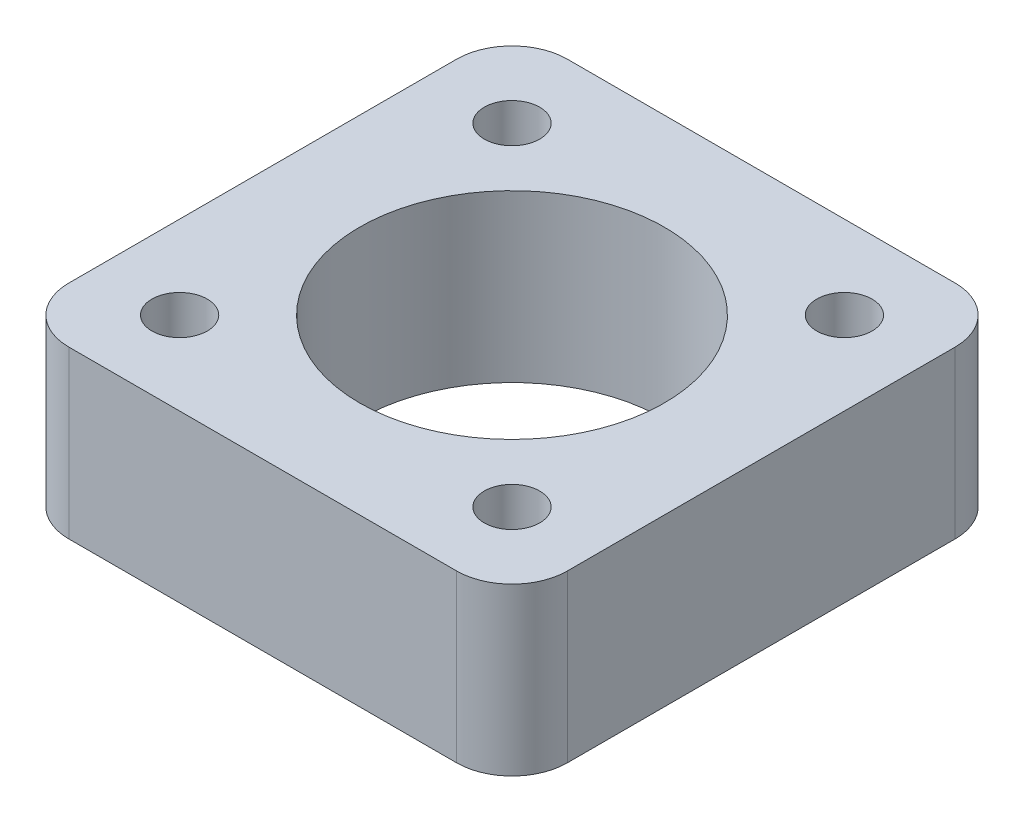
from build123d import *

# Parameters (mm, degrees)
SKETCH1_W            = 36
SKETCH1_H            = 36
BASE_EXTRUDE_DEPTH   = 12
SKETCH2_R            = 11
CENTER_HOLE_DEPTH    = 53.306787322
SKETCH3_R            = 2
MOUNTING_HOLE_DEPTH  = 53.306787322
LPATTERN1_COUNT      = 2
LPATTERN1_PITCH      = 24
LPATTERN1_COUNT_DIR2 = 2
LPATTERN1_PITCH_DIR2 = 24
FILLET1_R            = 4


with BuildPart() as part:
    # Sketch1 → Base-Extrude (new body)
    with BuildSketch(Plane(origin=(0, 0, 0), x_dir=(1, 0, 0), z_dir=(0, 1, 0))):
        with Locations((18, 18)):
            Rectangle(SKETCH1_W, SKETCH1_H)
    extrude(amount=BASE_EXTRUDE_DEPTH)

    # Sketch2 → center hole (cut, through all)
    with BuildSketch(Plane(origin=(0, 12, 0), x_dir=(-1, 0, 0), z_dir=(0, 1, 0))):
        with Locations(Location((-18, -18, 0), (0, 0, 90))):
            Circle(SKETCH2_R)
    extrude(amount=-CENTER_HOLE_DEPTH, mode=Mode.SUBTRACT)

    # Sketch3 → mounting hole (cut, through all)
    with BuildSketch(Plane(origin=(0, 12, 0), x_dir=(-1, 0, 0), z_dir=(0, 1, 0))):
        with Locations(Location((-6, -30, 0), (0, 0, 90))):
            Circle(SKETCH3_R)
    mounting_hole = extrude(amount=-MOUNTING_HOLE_DEPTH, mode=Mode.SUBTRACT)

    # LPattern1: mounting hole 2 × 2
    with Locations(*[(i * LPATTERN1_PITCH, 0, j * LPATTERN1_PITCH_DIR2) for i in range(LPATTERN1_COUNT) for j in range(LPATTERN1_COUNT_DIR2) if (i, j) != (0, 0)]):
        add(mounting_hole, mode=Mode.SUBTRACT)

    # Fillet1
    fillet1_edges = [part.edges().sort_by_distance(p)[0] for p in [
        (0, 6, 0),
        (36, 6, 0),
        (0, 6, -36),
        (36, 6, -36),
    ]]
    fillet(fillet1_edges, radius=FILLET1_R)


solid = part.part
